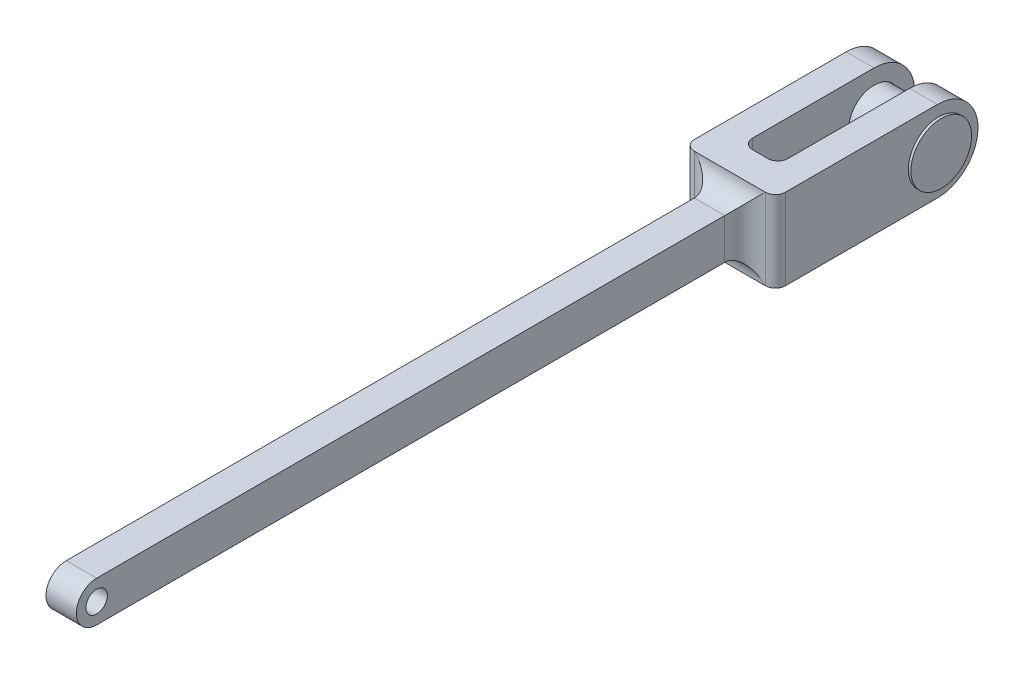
ISO-10303-21;
HEADER;
FILE_DESCRIPTION(('STEP AP214'),'2;1');
FILE_NAME('part.step','',(''),(''),'','','');
FILE_SCHEMA(('AUTOMOTIVE_DESIGN { 1 0 10303 214 1 1 1 1 }'));
ENDSEC;
DATA;
#1=APPLICATION_CONTEXT('core data for automotive mechanical design processes');
#2=APPLICATION_PROTOCOL_DEFINITION('international standard','automotive_design',2000,#1);
#3=PRODUCT_CONTEXT('',#1,'mechanical');
#4=PRODUCT('Part','Part','',(#3));
#5=PRODUCT_RELATED_PRODUCT_CATEGORY('part','',(#4));
#6=PRODUCT_DEFINITION_FORMATION('','',#4);
#7=PRODUCT_DEFINITION_CONTEXT('part definition',#1,'design');
#8=PRODUCT_DEFINITION('design','',#6,#7);
#9=PRODUCT_DEFINITION_SHAPE('','',#8);
#10=(LENGTH_UNIT() NAMED_UNIT(*) SI_UNIT(.MILLI.,.METRE.));
#11=(NAMED_UNIT(*) PLANE_ANGLE_UNIT() SI_UNIT($,.RADIAN.));
#12=(NAMED_UNIT(*) SI_UNIT($,.STERADIAN.) SOLID_ANGLE_UNIT());
#13=UNCERTAINTY_MEASURE_WITH_UNIT(LENGTH_MEASURE(1.E-05),#10,'distance_accuracy_value','');
#14=(GEOMETRIC_REPRESENTATION_CONTEXT(3) GLOBAL_UNCERTAINTY_ASSIGNED_CONTEXT((#13)) GLOBAL_UNIT_ASSIGNED_CONTEXT((#10,
#11,#12)) REPRESENTATION_CONTEXT('',''));
#15=CARTESIAN_POINT('',(0.,0.,0.));
#16=DIRECTION('',(0.,0.,1.));
#17=DIRECTION('',(1.,0.,0.));
#18=AXIS2_PLACEMENT_3D('',#15,#16,#17);
#19=CARTESIAN_POINT('',(29.36875,0.,-508.));
#20=DIRECTION('',(-1.,0.,0.));
#21=DIRECTION('',(0.,0.,1.));
#22=AXIS2_PLACEMENT_3D('',#19,#20,#21);
#23=CYLINDRICAL_SURFACE('',#22,15.875);
#24=CARTESIAN_POINT('',(29.36875,0.,-508.));
#25=DIRECTION('',(1.,0.,0.));
#26=DIRECTION('',(0.,0.,-1.));
#27=AXIS2_PLACEMENT_3D('',#24,#25,#26);
#28=CIRCLE('',#27,15.875);
#29=CARTESIAN_POINT('',(29.36875,0.,-523.875));
#30=VERTEX_POINT('',#29);
#31=EDGE_CURVE('E11',#30,#30,#28,.T.);
#32=ORIENTED_EDGE('',*,*,#31,.F.);
#33=EDGE_LOOP('',(#32));
#34=FACE_BOUND('',#33,.T.);
#35=CARTESIAN_POINT('',(-29.36875,0.,-508.));
#36=DIRECTION('',(1.,0.,0.));
#37=DIRECTION('',(0.,0.,-1.));
#38=AXIS2_PLACEMENT_3D('',#35,#36,#37);
#39=CIRCLE('',#38,15.875);
#40=CARTESIAN_POINT('',(-29.36875,0.,-523.875));
#41=VERTEX_POINT('',#40);
#42=EDGE_CURVE('E48',#41,#41,#39,.T.);
#43=ORIENTED_EDGE('',*,*,#42,.T.);
#44=EDGE_LOOP('',(#43));
#45=FACE_BOUND('',#44,.T.);
#46=ADVANCED_FACE('F45',(#34,#45),#23,.T.);
#47=CARTESIAN_POINT('',(30.95625,0.,-508.));
#48=DIRECTION('',(-1.,0.,0.));
#49=DIRECTION('',(0.,0.,1.));
#50=AXIS2_PLACEMENT_3D('',#47,#48,#49);
#51=CYLINDRICAL_SURFACE('',#50,19.05);
#52=CARTESIAN_POINT('',(30.95625,0.,-508.));
#53=DIRECTION('',(1.,0.,0.));
#54=DIRECTION('',(0.,0.,-1.));
#55=AXIS2_PLACEMENT_3D('',#52,#53,#54);
#56=CIRCLE('',#55,19.05);
#57=CARTESIAN_POINT('',(30.95625,0.,-527.05));
#58=VERTEX_POINT('',#57);
#59=EDGE_CURVE('E52',#58,#58,#56,.T.);
#60=ORIENTED_EDGE('',*,*,#59,.F.);
#61=EDGE_LOOP('',(#60));
#62=FACE_BOUND('',#61,.T.);
#63=CARTESIAN_POINT('',(29.36875,0.,-508.));
#64=DIRECTION('',(1.,0.,0.));
#65=DIRECTION('',(0.,0.,-1.));
#66=AXIS2_PLACEMENT_3D('',#63,#64,#65);
#67=CIRCLE('',#66,19.05);
#68=CARTESIAN_POINT('',(29.36875,0.,-527.05));
#69=VERTEX_POINT('',#68);
#70=EDGE_CURVE('E56',#69,#69,#67,.T.);
#71=ORIENTED_EDGE('',*,*,#70,.T.);
#72=EDGE_LOOP('',(#71));
#73=FACE_BOUND('',#72,.T.);
#74=ADVANCED_FACE('F93',(#62,#73),#51,.T.);
#75=CARTESIAN_POINT('',(30.95625,0.,-508.));
#76=DIRECTION('',(1.,0.,0.));
#77=DIRECTION('',(0.,0.,-1.));
#78=AXIS2_PLACEMENT_3D('',#75,#76,#77);
#79=PLANE('',#78);
#80=ORIENTED_EDGE('',*,*,#59,.T.);
#81=EDGE_LOOP('',(#80));
#82=FACE_BOUND('',#81,.T.);
#83=ADVANCED_FACE('F89',(#82),#79,.T.);
#84=CARTESIAN_POINT('',(29.36875,0.,-508.));
#85=DIRECTION('',(1.,0.,0.));
#86=DIRECTION('',(0.,0.,-1.));
#87=AXIS2_PLACEMENT_3D('',#84,#85,#86);
#88=PLANE('',#87);
#89=ORIENTED_EDGE('',*,*,#31,.T.);
#90=EDGE_LOOP('',(#89));
#91=FACE_BOUND('',#90,.T.);
#92=ORIENTED_EDGE('',*,*,#70,.F.);
#93=EDGE_LOOP('',(#92));
#94=FACE_BOUND('',#93,.T.);
#95=ADVANCED_FACE('F81',(#91,#94),#88,.F.);
#96=CARTESIAN_POINT('',(-30.95625,0.,-508.));
#97=DIRECTION('',(1.,0.,0.));
#98=DIRECTION('',(0.,0.,-1.));
#99=AXIS2_PLACEMENT_3D('',#96,#97,#98);
#100=CYLINDRICAL_SURFACE('',#99,19.05);
#101=CARTESIAN_POINT('',(-30.95625,0.,-508.));
#102=DIRECTION('',(1.,0.,0.));
#103=DIRECTION('',(0.,0.,-1.));
#104=AXIS2_PLACEMENT_3D('',#101,#102,#103);
#105=CIRCLE('',#104,19.05);
#106=CARTESIAN_POINT('',(-30.95625,0.,-527.05));
#107=VERTEX_POINT('',#106);
#108=EDGE_CURVE('E64',#107,#107,#105,.T.);
#109=ORIENTED_EDGE('',*,*,#108,.T.);
#110=EDGE_LOOP('',(#109));
#111=FACE_BOUND('',#110,.T.);
#112=CARTESIAN_POINT('',(-29.36875,0.,-508.));
#113=DIRECTION('',(1.,0.,0.));
#114=DIRECTION('',(0.,0.,-1.));
#115=AXIS2_PLACEMENT_3D('',#112,#113,#114);
#116=CIRCLE('',#115,19.05);
#117=CARTESIAN_POINT('',(-29.36875,0.,-527.05));
#118=VERTEX_POINT('',#117);
#119=EDGE_CURVE('E61',#118,#118,#116,.T.);
#120=ORIENTED_EDGE('',*,*,#119,.F.);
#121=EDGE_LOOP('',(#120));
#122=FACE_BOUND('',#121,.T.);
#123=ADVANCED_FACE('F79',(#111,#122),#100,.T.);
#124=CARTESIAN_POINT('',(-30.95625,0.,-508.));
#125=DIRECTION('',(-1.,0.,0.));
#126=DIRECTION('',(0.,0.,-1.));
#127=AXIS2_PLACEMENT_3D('',#124,#125,#126);
#128=PLANE('',#127);
#129=ORIENTED_EDGE('',*,*,#108,.F.);
#130=EDGE_LOOP('',(#129));
#131=FACE_BOUND('',#130,.T.);
#132=ADVANCED_FACE('F75',(#131),#128,.T.);
#133=CARTESIAN_POINT('',(-29.36875,0.,-508.));
#134=DIRECTION('',(-1.,0.,0.));
#135=DIRECTION('',(0.,0.,-1.));
#136=AXIS2_PLACEMENT_3D('',#133,#134,#135);
#137=PLANE('',#136);
#138=ORIENTED_EDGE('',*,*,#42,.F.);
#139=EDGE_LOOP('',(#138));
#140=FACE_BOUND('',#139,.T.);
#141=ORIENTED_EDGE('',*,*,#119,.T.);
#142=EDGE_LOOP('',(#141));
#143=FACE_BOUND('',#142,.T.);
#144=ADVANCED_FACE('F72',(#140,#143),#137,.F.);
#145=CLOSED_SHELL('',(#46,#74,#83,#95,#123,#132,#144));
#146=MANIFOLD_SOLID_BREP('B2',#145);
#147=CARTESIAN_POINT('',(-165.358186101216,0.,-508.));
#148=DIRECTION('',(1.,0.,0.));
#149=DIRECTION('',(0.,0.,-1.));
#150=AXIS2_PLACEMENT_3D('',#147,#148,#149);
#151=CYLINDRICAL_SURFACE('',#150,25.4);
#152=CARTESIAN_POINT('',(11.1125,0.,-508.));
#153=DIRECTION('',(1.,0.,0.));
#154=DIRECTION('',(0.,0.,-1.));
#155=AXIS2_PLACEMENT_3D('',#152,#153,#154);
#156=CIRCLE('',#155,25.4);
#157=CARTESIAN_POINT('',(11.1125,25.4,-508.));
#158=VERTEX_POINT('',#157);
#159=CARTESIAN_POINT('',(11.1125,-25.4,-508.));
#160=VERTEX_POINT('',#159);
#161=EDGE_CURVE('E352',#158,#160,#156,.F.);
#162=ORIENTED_EDGE('',*,*,#161,.F.);
#163=DIRECTION('',(1.,0.,0.));
#164=VECTOR('',#163,1.);
#165=CARTESIAN_POINT('',(-165.358186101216,25.4,-508.));
#166=LINE('',#165,#164);
#167=CARTESIAN_POINT('',(28.575,25.4,-508.));
#168=VERTEX_POINT('',#167);
#169=EDGE_CURVE('E309',#158,#168,#166,.T.);
#170=ORIENTED_EDGE('',*,*,#169,.T.);
#171=CARTESIAN_POINT('',(28.575,0.,-508.));
#172=DIRECTION('',(1.,0.,0.));
#173=DIRECTION('',(0.,0.,1.));
#174=AXIS2_PLACEMENT_3D('',#171,#172,#173);
#175=CIRCLE('',#174,25.4);
#176=CARTESIAN_POINT('',(28.575,-25.4,-508.));
#177=VERTEX_POINT('',#176);
#178=EDGE_CURVE('E435',#177,#168,#175,.T.);
#179=ORIENTED_EDGE('',*,*,#178,.F.);
#180=DIRECTION('',(1.,0.,0.));
#181=VECTOR('',#180,1.);
#182=CARTESIAN_POINT('',(-165.358186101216,-25.4,-508.));
#183=LINE('',#182,#181);
#184=EDGE_CURVE('E310',#160,#177,#183,.T.);
#185=ORIENTED_EDGE('',*,*,#184,.F.);
#186=EDGE_LOOP('',(#162,#170,#179,#185));
#187=FACE_BOUND('',#186,.T.);
#188=ADVANCED_FACE('F165',(#187),#151,.T.);
#189=CARTESIAN_POINT('',(-74.0150959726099,0.,-508.));
#190=DIRECTION('',(1.,0.,0.));
#191=DIRECTION('',(0.,0.,-1.));
#192=AXIS2_PLACEMENT_3D('',#189,#190,#191);
#193=CYLINDRICAL_SURFACE('',#192,16.0655);
#194=CARTESIAN_POINT('',(11.1125,0.,-508.));
#195=DIRECTION('',(1.,0.,0.));
#196=DIRECTION('',(0.,0.,-1.));
#197=AXIS2_PLACEMENT_3D('',#194,#195,#196);
#198=CIRCLE('',#197,16.0655);
#199=CARTESIAN_POINT('',(11.1125,0.,-524.0655));
#200=VERTEX_POINT('',#199);
#201=EDGE_CURVE('E302',#200,#200,#198,.F.);
#202=ORIENTED_EDGE('',*,*,#201,.T.);
#203=EDGE_LOOP('',(#202));
#204=FACE_BOUND('',#203,.T.);
#205=CARTESIAN_POINT('',(28.575,0.,-508.));
#206=DIRECTION('',(1.,0.,0.));
#207=DIRECTION('',(0.,0.,-1.));
#208=AXIS2_PLACEMENT_3D('',#205,#206,#207);
#209=CIRCLE('',#208,16.0655);
#210=CARTESIAN_POINT('',(28.575,0.,-524.0655));
#211=VERTEX_POINT('',#210);
#212=EDGE_CURVE('E421',#211,#211,#209,.T.);
#213=ORIENTED_EDGE('',*,*,#212,.T.);
#214=EDGE_LOOP('',(#213));
#215=FACE_BOUND('',#214,.T.);
#216=ADVANCED_FACE('F498',(#204,#215),#193,.F.);
#217=CARTESIAN_POINT('',(9.525,0.,0.));
#218=DIRECTION('',(1.,0.,0.));
#219=DIRECTION('',(0.,0.,-1.));
#220=AXIS2_PLACEMENT_3D('',#217,#218,#219);
#221=PLANE('',#220);
#222=DIRECTION('',(0.,0.,-1.));
#223=VECTOR('',#222,1.);
#224=CARTESIAN_POINT('',(9.525,-12.7,0.));
#225=LINE('',#224,#223);
#226=CARTESIAN_POINT('',(9.525,-12.7,0.));
#227=VERTEX_POINT('',#226);
#228=CARTESIAN_POINT('',(9.525,-12.7,-393.7));
#229=VERTEX_POINT('',#228);
#230=EDGE_CURVE('E330',#227,#229,#225,.T.);
#231=ORIENTED_EDGE('',*,*,#230,.T.);
#232=DIRECTION('',(0.,-1.,0.));
#233=VECTOR('',#232,1.);
#234=CARTESIAN_POINT('',(9.525,12.7,-393.7));
#235=LINE('',#234,#233);
#236=CARTESIAN_POINT('',(9.525,12.7,-393.7));
#237=VERTEX_POINT('',#236);
#238=EDGE_CURVE('E43',#229,#237,#235,.F.);
#239=ORIENTED_EDGE('',*,*,#238,.T.);
#240=DIRECTION('',(0.,0.,1.));
#241=VECTOR('',#240,1.);
#242=CARTESIAN_POINT('',(9.525,12.7,0.));
#243=LINE('',#242,#241);
#244=CARTESIAN_POINT('',(9.525,12.7,0.));
#245=VERTEX_POINT('',#244);
#246=EDGE_CURVE('E333',#237,#245,#243,.T.);
#247=ORIENTED_EDGE('',*,*,#246,.T.);
#248=CARTESIAN_POINT('',(9.525,0.,0.));
#249=DIRECTION('',(1.,0.,0.));
#250=DIRECTION('',(0.,0.,-1.));
#251=AXIS2_PLACEMENT_3D('',#248,#249,#250);
#252=CIRCLE('',#251,12.7);
#253=EDGE_CURVE('E327',#245,#227,#252,.T.);
#254=ORIENTED_EDGE('',*,*,#253,.T.);
#255=EDGE_LOOP('',(#231,#239,#247,#254));
#256=FACE_BOUND('',#255,.T.);
#257=CARTESIAN_POINT('',(9.525,0.,0.));
#258=DIRECTION('',(1.,0.,0.));
#259=DIRECTION('',(0.,0.,-1.));
#260=AXIS2_PLACEMENT_3D('',#257,#258,#259);
#261=CIRCLE('',#260,6.731);
#262=CARTESIAN_POINT('',(9.525,0.,6.731));
#263=VERTEX_POINT('',#262);
#264=EDGE_CURVE('E320',#263,#263,#261,.T.);
#265=ORIENTED_EDGE('',*,*,#264,.F.);
#266=EDGE_LOOP('',(#265));
#267=FACE_BOUND('',#266,.T.);
#268=ADVANCED_FACE('F503',(#256,#267),#221,.T.);
#269=CARTESIAN_POINT('',(-9.525,0.,0.));
#270=DIRECTION('',(1.,0.,0.));
#271=DIRECTION('',(0.,0.,-1.));
#272=AXIS2_PLACEMENT_3D('',#269,#270,#271);
#273=PLANE('',#272);
#274=DIRECTION('',(0.,0.,1.));
#275=VECTOR('',#274,1.);
#276=CARTESIAN_POINT('',(-9.525,12.7,0.));
#277=LINE('',#276,#275);
#278=CARTESIAN_POINT('',(-9.525,12.7,-393.7));
#279=VERTEX_POINT('',#278);
#280=CARTESIAN_POINT('',(-9.525,12.7,0.));
#281=VERTEX_POINT('',#280);
#282=EDGE_CURVE('E331',#279,#281,#277,.T.);
#283=ORIENTED_EDGE('',*,*,#282,.F.);
#284=DIRECTION('',(0.,-1.,0.));
#285=VECTOR('',#284,1.);
#286=CARTESIAN_POINT('',(-9.525,0.,-393.7));
#287=LINE('',#286,#285);
#288=CARTESIAN_POINT('',(-9.525,-12.7,-393.7));
#289=VERTEX_POINT('',#288);
#290=EDGE_CURVE('E174',#279,#289,#287,.T.);
#291=ORIENTED_EDGE('',*,*,#290,.T.);
#292=DIRECTION('',(0.,0.,-1.));
#293=VECTOR('',#292,1.);
#294=CARTESIAN_POINT('',(-9.525,-12.7,0.));
#295=LINE('',#294,#293);
#296=CARTESIAN_POINT('',(-9.525,-12.7,0.));
#297=VERTEX_POINT('',#296);
#298=EDGE_CURVE('E338',#297,#289,#295,.T.);
#299=ORIENTED_EDGE('',*,*,#298,.F.);
#300=CARTESIAN_POINT('',(-9.525,0.,0.));
#301=DIRECTION('',(1.,0.,0.));
#302=DIRECTION('',(0.,0.,-1.));
#303=AXIS2_PLACEMENT_3D('',#300,#301,#302);
#304=CIRCLE('',#303,12.7);
#305=EDGE_CURVE('E323',#281,#297,#304,.T.);
#306=ORIENTED_EDGE('',*,*,#305,.F.);
#307=EDGE_LOOP('',(#283,#291,#299,#306));
#308=FACE_BOUND('',#307,.T.);
#309=CARTESIAN_POINT('',(-9.525,0.,0.));
#310=DIRECTION('',(1.,0.,0.));
#311=DIRECTION('',(0.,0.,-1.));
#312=AXIS2_PLACEMENT_3D('',#309,#310,#311);
#313=CIRCLE('',#312,6.731);
#314=CARTESIAN_POINT('',(-9.525,0.,6.731));
#315=VERTEX_POINT('',#314);
#316=EDGE_CURVE('E324',#315,#315,#313,.T.);
#317=ORIENTED_EDGE('',*,*,#316,.T.);
#318=EDGE_LOOP('',(#317));
#319=FACE_BOUND('',#318,.T.);
#320=ADVANCED_FACE('F608',(#308,#319),#273,.F.);
#321=CARTESIAN_POINT('',(9.525,0.,0.));
#322=DIRECTION('',(-1.,0.,0.));
#323=DIRECTION('',(0.,0.,1.));
#324=AXIS2_PLACEMENT_3D('',#321,#322,#323);
#325=CYLINDRICAL_SURFACE('',#324,12.7);
#326=ORIENTED_EDGE('',*,*,#305,.T.);
#327=DIRECTION('',(-1.,0.,0.));
#328=VECTOR('',#327,1.);
#329=CARTESIAN_POINT('',(9.525,-12.7,0.));
#330=LINE('',#329,#328);
#331=EDGE_CURVE('E344',#227,#297,#330,.T.);
#332=ORIENTED_EDGE('',*,*,#331,.F.);
#333=ORIENTED_EDGE('',*,*,#253,.F.);
#334=DIRECTION('',(-1.,0.,0.));
#335=VECTOR('',#334,1.);
#336=CARTESIAN_POINT('',(9.525,12.7,0.));
#337=LINE('',#336,#335);
#338=EDGE_CURVE('E335',#245,#281,#337,.T.);
#339=ORIENTED_EDGE('',*,*,#338,.T.);
#340=EDGE_LOOP('',(#326,#332,#333,#339));
#341=FACE_BOUND('',#340,.T.);
#342=ADVANCED_FACE('F531',(#341),#325,.T.);
#343=CARTESIAN_POINT('',(9.525,-12.7,0.));
#344=DIRECTION('',(0.,1.,0.));
#345=DIRECTION('',(0.,0.,1.));
#346=AXIS2_PLACEMENT_3D('',#343,#344,#345);
#347=PLANE('',#346);
#348=ORIENTED_EDGE('',*,*,#298,.T.);
#349=DIRECTION('',(1.,0.,0.));
#350=VECTOR('',#349,1.);
#351=CARTESIAN_POINT('',(9.525,-12.7,-393.7));
#352=LINE('',#351,#350);
#353=EDGE_CURVE('E389',#289,#229,#352,.T.);
#354=ORIENTED_EDGE('',*,*,#353,.T.);
#355=ORIENTED_EDGE('',*,*,#230,.F.);
#356=ORIENTED_EDGE('',*,*,#331,.T.);
#357=EDGE_LOOP('',(#348,#354,#355,#356));
#358=FACE_BOUND('',#357,.T.);
#359=ADVANCED_FACE('F589',(#358),#347,.F.);
#360=CARTESIAN_POINT('',(9.525,12.7,0.));
#361=DIRECTION('',(0.,-1.,0.));
#362=DIRECTION('',(0.,0.,-1.));
#363=AXIS2_PLACEMENT_3D('',#360,#361,#362);
#364=PLANE('',#363);
#365=ORIENTED_EDGE('',*,*,#246,.F.);
#366=DIRECTION('',(-1.,0.,0.));
#367=VECTOR('',#366,1.);
#368=CARTESIAN_POINT('',(9.525,12.7,-393.7));
#369=LINE('',#368,#367);
#370=EDGE_CURVE('E182',#237,#279,#369,.T.);
#371=ORIENTED_EDGE('',*,*,#370,.T.);
#372=ORIENTED_EDGE('',*,*,#282,.T.);
#373=ORIENTED_EDGE('',*,*,#338,.F.);
#374=EDGE_LOOP('',(#365,#371,#372,#373));
#375=FACE_BOUND('',#374,.T.);
#376=ADVANCED_FACE('F584',(#375),#364,.F.);
#377=CARTESIAN_POINT('',(9.525,0.,0.));
#378=DIRECTION('',(-1.,0.,0.));
#379=DIRECTION('',(0.,0.,1.));
#380=AXIS2_PLACEMENT_3D('',#377,#378,#379);
#381=CYLINDRICAL_SURFACE('',#380,6.731);
#382=CARTESIAN_POINT('',(9.525,0.,6.731));
#383=CARTESIAN_POINT('',(9.3265625,0.,6.731));
#384=CARTESIAN_POINT('',(9.128125,0.,6.731));
#385=CARTESIAN_POINT('',(8.73125,0.,6.731));
#386=CARTESIAN_POINT('',(8.5328125,0.,6.731));
#387=CARTESIAN_POINT('',(8.1359375,0.,6.731));
#388=CARTESIAN_POINT('',(7.9375,0.,6.731));
#389=CARTESIAN_POINT('',(7.540625,0.,6.731));
#390=CARTESIAN_POINT('',(7.3421875,0.,6.731));
#391=CARTESIAN_POINT('',(6.9453125,0.,6.731));
#392=CARTESIAN_POINT('',(6.746875,0.,6.731));
#393=CARTESIAN_POINT('',(6.35,0.,6.731));
#394=CARTESIAN_POINT('',(6.1515625,0.,6.731));
#395=CARTESIAN_POINT('',(5.7546875,0.,6.731));
#396=CARTESIAN_POINT('',(5.55625,0.,6.731));
#397=CARTESIAN_POINT('',(5.159375,0.,6.731));
#398=CARTESIAN_POINT('',(4.9609375,0.,6.731));
#399=CARTESIAN_POINT('',(4.5640625,0.,6.731));
#400=CARTESIAN_POINT('',(4.365625,0.,6.731));
#401=CARTESIAN_POINT('',(3.96875,0.,6.731));
#402=CARTESIAN_POINT('',(3.7703125,0.,6.731));
#403=CARTESIAN_POINT('',(3.3734375,0.,6.731));
#404=CARTESIAN_POINT('',(3.175,0.,6.731));
#405=CARTESIAN_POINT('',(2.778125,0.,6.731));
#406=CARTESIAN_POINT('',(2.5796875,0.,6.731));
#407=CARTESIAN_POINT('',(2.1828125,0.,6.731));
#408=CARTESIAN_POINT('',(1.984375,0.,6.731));
#409=CARTESIAN_POINT('',(1.5875,0.,6.731));
#410=CARTESIAN_POINT('',(1.3890625,0.,6.731));
#411=CARTESIAN_POINT('',(0.992187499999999,0.,6.731));
#412=CARTESIAN_POINT('',(0.793749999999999,0.,6.731));
#413=CARTESIAN_POINT('',(0.396874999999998,0.,6.731));
#414=CARTESIAN_POINT('',(0.198437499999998,0.,6.731));
#415=CARTESIAN_POINT('',(-0.198437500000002,0.,6.731));
#416=CARTESIAN_POINT('',(-0.396875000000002,0.,6.731));
#417=CARTESIAN_POINT('',(-0.793750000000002,0.,6.731));
#418=CARTESIAN_POINT('',(-0.992187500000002,0.,6.731));
#419=CARTESIAN_POINT('',(-1.3890625,0.,6.731));
#420=CARTESIAN_POINT('',(-1.5875,0.,6.731));
#421=CARTESIAN_POINT('',(-1.984375,0.,6.731));
#422=CARTESIAN_POINT('',(-2.1828125,0.,6.731));
#423=CARTESIAN_POINT('',(-2.5796875,0.,6.731));
#424=CARTESIAN_POINT('',(-2.778125,0.,6.731));
#425=CARTESIAN_POINT('',(-3.175,0.,6.731));
#426=CARTESIAN_POINT('',(-3.3734375,0.,6.731));
#427=CARTESIAN_POINT('',(-3.7703125,0.,6.731));
#428=CARTESIAN_POINT('',(-3.96875,0.,6.731));
#429=CARTESIAN_POINT('',(-4.365625,0.,6.731));
#430=CARTESIAN_POINT('',(-4.5640625,0.,6.731));
#431=CARTESIAN_POINT('',(-4.9609375,0.,6.731));
#432=CARTESIAN_POINT('',(-5.159375,0.,6.731));
#433=CARTESIAN_POINT('',(-5.55625,0.,6.731));
#434=CARTESIAN_POINT('',(-5.7546875,0.,6.731));
#435=CARTESIAN_POINT('',(-6.1515625,0.,6.731));
#436=CARTESIAN_POINT('',(-6.35,0.,6.731));
#437=CARTESIAN_POINT('',(-6.746875,0.,6.731));
#438=CARTESIAN_POINT('',(-6.9453125,0.,6.731));
#439=CARTESIAN_POINT('',(-7.3421875,0.,6.731));
#440=CARTESIAN_POINT('',(-7.540625,0.,6.731));
#441=CARTESIAN_POINT('',(-7.9375,0.,6.731));
#442=CARTESIAN_POINT('',(-8.1359375,0.,6.731));
#443=CARTESIAN_POINT('',(-8.5328125,0.,6.731));
#444=CARTESIAN_POINT('',(-8.73125,0.,6.731));
#445=CARTESIAN_POINT('',(-9.128125,0.,6.731));
#446=CARTESIAN_POINT('',(-9.3265625,0.,6.731));
#447=CARTESIAN_POINT('',(-9.525,0.,6.731));
#448=B_SPLINE_CURVE_WITH_KNOTS('',3,(#382,#383,#384,#385,#386,#387,#388,#389,#390,#391,#392,
#393,#394,#395,#396,#397,#398,#399,#400,#401,#402,#403,#404,#405,#406,#407,#408,#409,#410,#411,
#412,#413,#414,#415,#416,#417,#418,#419,#420,#421,#422,#423,#424,#425,#426,#427,#428,#429,#430,
#431,#432,#433,#434,#435,#436,#437,#438,#439,#440,#441,#442,#443,#444,#445,#446,#447),
.UNSPECIFIED.,.F.,.F.,(4,2,2,2,2,2,2,2,2,2,2,2,2,2,2,2,2,2,2,2,2,2,2,2,2,2,2,2,2,2,2,2,4),(0.,
0.595312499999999,1.190625,1.7859375,2.38125,2.9765625,3.571875,4.1671875,4.7625,5.3578125,
5.953125,6.5484375,7.14375,7.7390625,8.334375,8.9296875,9.525,10.1203125,10.715625,11.3109375,
11.90625,12.5015625,13.096875,13.6921875,14.2875,14.8828125,15.478125,16.0734375,16.66875,
17.2640625,17.859375,18.4546875,19.05),.UNSPECIFIED.);
#449=EDGE_CURVE('BSEAM493',#263,#315,#448,.T.);
#450=ORIENTED_EDGE('',*,*,#264,.T.);
#451=ORIENTED_EDGE('',*,*,#316,.F.);
#452=ORIENTED_EDGE('',*,*,#449,.T.);
#453=ORIENTED_EDGE('',*,*,#449,.F.);
#454=EDGE_LOOP('',(#450,#452,#451,#453));
#455=FACE_BOUND('',#454,.T.);
#456=ADVANCED_FACE('F493',(#455),#381,.F.);
#457=CARTESIAN_POINT('',(-28.575,0.,0.));
#458=DIRECTION('',(1.,0.,0.));
#459=DIRECTION('',(0.,0.,-1.));
#460=AXIS2_PLACEMENT_3D('',#457,#458,#459);
#461=PLANE('',#460);
#462=CARTESIAN_POINT('',(-28.575,0.,-508.));
#463=DIRECTION('',(1.,0.,0.));
#464=DIRECTION('',(0.,0.,-1.));
#465=AXIS2_PLACEMENT_3D('',#462,#463,#464);
#466=CIRCLE('',#465,16.0655);
#467=CARTESIAN_POINT('',(-28.575,0.,-524.0655));
#468=VERTEX_POINT('',#467);
#469=EDGE_CURVE('E424',#468,#468,#466,.F.);
#470=ORIENTED_EDGE('',*,*,#469,.F.);
#471=EDGE_LOOP('',(#470));
#472=FACE_BOUND('',#471,.T.);
#473=DIRECTION('',(0.,0.,1.));
#474=VECTOR('',#473,1.);
#475=CARTESIAN_POINT('',(-28.575,-25.4,-508.));
#476=LINE('',#475,#474);
#477=CARTESIAN_POINT('',(-28.5750000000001,-25.4,-508.));
#478=VERTEX_POINT('',#477);
#479=CARTESIAN_POINT('',(-28.575,-25.4,-412.75));
#480=VERTEX_POINT('',#479);
#481=EDGE_CURVE('E308',#478,#480,#476,.T.);
#482=ORIENTED_EDGE('',*,*,#481,.T.);
#483=DIRECTION('',(0.,1.,0.));
#484=VECTOR('',#483,1.);
#485=CARTESIAN_POINT('',(-28.575,25.4,-412.75));
#486=LINE('',#485,#484);
#487=CARTESIAN_POINT('',(-28.575,25.4,-412.75));
#488=VERTEX_POINT('',#487);
#489=EDGE_CURVE('E369',#480,#488,#486,.T.);
#490=ORIENTED_EDGE('',*,*,#489,.T.);
#491=DIRECTION('',(0.,0.,-1.));
#492=VECTOR('',#491,1.);
#493=CARTESIAN_POINT('',(-28.575,25.4,-406.4));
#494=LINE('',#493,#492);
#495=CARTESIAN_POINT('',(-28.575,25.4,-508.));
#496=VERTEX_POINT('',#495);
#497=EDGE_CURVE('E429',#488,#496,#494,.T.);
#498=ORIENTED_EDGE('',*,*,#497,.T.);
#499=CARTESIAN_POINT('',(-28.575,0.,-508.));
#500=DIRECTION('',(1.,0.,0.));
#501=DIRECTION('',(0.,0.,-1.));
#502=AXIS2_PLACEMENT_3D('',#499,#500,#501);
#503=CIRCLE('',#502,25.4);
#504=EDGE_CURVE('E430',#496,#478,#503,.F.);
#505=ORIENTED_EDGE('',*,*,#504,.T.);
#506=EDGE_LOOP('',(#482,#490,#498,#505));
#507=FACE_BOUND('',#506,.T.);
#508=ADVANCED_FACE('F463',(#472,#507),#461,.F.);
#509=CARTESIAN_POINT('',(28.575,0.,-508.));
#510=DIRECTION('',(1.,0.,0.));
#511=DIRECTION('',(0.,0.,-1.));
#512=AXIS2_PLACEMENT_3D('',#509,#510,#511);
#513=PLANE('',#512);
#514=ORIENTED_EDGE('',*,*,#212,.F.);
#515=EDGE_LOOP('',(#514));
#516=FACE_BOUND('',#515,.T.);
#517=DIRECTION('',(0.,0.,1.));
#518=VECTOR('',#517,1.);
#519=CARTESIAN_POINT('',(28.575,25.4,-406.4));
#520=LINE('',#519,#518);
#521=CARTESIAN_POINT('',(28.575,25.4,-412.75));
#522=VERTEX_POINT('',#521);
#523=EDGE_CURVE('E319',#168,#522,#520,.T.);
#524=ORIENTED_EDGE('',*,*,#523,.T.);
#525=DIRECTION('',(0.,-1.,0.));
#526=VECTOR('',#525,1.);
#527=CARTESIAN_POINT('',(28.575,0.,-412.75));
#528=LINE('',#527,#526);
#529=CARTESIAN_POINT('',(28.575,-25.4,-412.75));
#530=VERTEX_POINT('',#529);
#531=EDGE_CURVE('E347',#522,#530,#528,.T.);
#532=ORIENTED_EDGE('',*,*,#531,.T.);
#533=DIRECTION('',(0.,0.,-1.));
#534=VECTOR('',#533,1.);
#535=CARTESIAN_POINT('',(28.575,-25.4,-508.));
#536=LINE('',#535,#534);
#537=EDGE_CURVE('E427',#530,#177,#536,.T.);
#538=ORIENTED_EDGE('',*,*,#537,.T.);
#539=ORIENTED_EDGE('',*,*,#178,.T.);
#540=EDGE_LOOP('',(#524,#532,#538,#539));
#541=FACE_BOUND('',#540,.T.);
#542=ADVANCED_FACE('F484',(#516,#541),#513,.T.);
#543=CARTESIAN_POINT('',(-165.358186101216,-25.4,-508.));
#544=DIRECTION('',(0.,-1.,0.));
#545=DIRECTION('',(0.,0.,-1.));
#546=AXIS2_PLACEMENT_3D('',#543,#544,#545);
#547=PLANE('',#546);
#548=ORIENTED_EDGE('',*,*,#537,.F.);
#549=CARTESIAN_POINT('',(22.225,-25.4,-412.75));
#550=DIRECTION('',(0.,-1.,0.));
#551=DIRECTION('',(0.,0.,-1.));
#552=AXIS2_PLACEMENT_3D('',#549,#550,#551);
#553=CIRCLE('',#552,6.35);
#554=CARTESIAN_POINT('',(22.2249999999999,-25.4,-406.4));
#555=VERTEX_POINT('',#554);
#556=EDGE_CURVE('E357',#530,#555,#553,.T.);
#557=ORIENTED_EDGE('',*,*,#556,.T.);
#558=DIRECTION('',(1.,0.,0.));
#559=VECTOR('',#558,1.);
#560=CARTESIAN_POINT('',(-165.358186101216,-25.4,-406.4));
#561=LINE('',#560,#559);
#562=CARTESIAN_POINT('',(-22.2250000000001,-25.4,-406.4));
#563=VERTEX_POINT('',#562);
#564=EDGE_CURVE('E314',#563,#555,#561,.T.);
#565=ORIENTED_EDGE('',*,*,#564,.F.);
#566=CARTESIAN_POINT('',(-22.225,-25.4,-412.75));
#567=DIRECTION('',(0.,-1.,0.));
#568=DIRECTION('',(0.,0.,-1.));
#569=AXIS2_PLACEMENT_3D('',#566,#567,#568);
#570=CIRCLE('',#569,6.35);
#571=EDGE_CURVE('E355',#563,#480,#570,.T.);
#572=ORIENTED_EDGE('',*,*,#571,.T.);
#573=ORIENTED_EDGE('',*,*,#481,.F.);
#574=CARTESIAN_POINT('',(-11.1125,-25.4,-508.));
#575=VERTEX_POINT('',#574);
#576=EDGE_CURVE('E298',#478,#575,#183,.T.);
#577=ORIENTED_EDGE('',*,*,#576,.T.);
#578=DIRECTION('',(0.,0.,1.));
#579=VECTOR('',#578,1.);
#580=CARTESIAN_POINT('',(-11.1125,-25.4,-590.55));
#581=LINE('',#580,#579);
#582=CARTESIAN_POINT('',(-11.1125,-25.4,-431.8));
#583=VERTEX_POINT('',#582);
#584=EDGE_CURVE('E278',#575,#583,#581,.T.);
#585=ORIENTED_EDGE('',*,*,#584,.T.);
#586=CARTESIAN_POINT('',(-4.76249999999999,-25.4,-431.8));
#587=DIRECTION('',(0.,-1.,0.));
#588=DIRECTION('',(0.,0.,-1.));
#589=AXIS2_PLACEMENT_3D('',#586,#587,#588);
#590=CIRCLE('',#589,6.35);
#591=CARTESIAN_POINT('',(-4.76249999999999,-25.4,-425.45));
#592=VERTEX_POINT('',#591);
#593=EDGE_CURVE('E387',#583,#592,#590,.F.);
#594=ORIENTED_EDGE('',*,*,#593,.T.);
#595=DIRECTION('',(1.,0.,0.));
#596=VECTOR('',#595,1.);
#597=CARTESIAN_POINT('',(-11.1125,-25.4,-425.45));
#598=LINE('',#597,#596);
#599=CARTESIAN_POINT('',(4.76250000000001,-25.4,-425.45));
#600=VERTEX_POINT('',#599);
#601=EDGE_CURVE('E290',#592,#600,#598,.T.);
#602=ORIENTED_EDGE('',*,*,#601,.T.);
#603=CARTESIAN_POINT('',(4.76250000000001,-25.4,-431.8));
#604=DIRECTION('',(0.,-1.,0.));
#605=DIRECTION('',(0.,0.,-1.));
#606=AXIS2_PLACEMENT_3D('',#603,#604,#605);
#607=CIRCLE('',#606,6.35);
#608=CARTESIAN_POINT('',(11.1125,-25.4,-431.8));
#609=VERTEX_POINT('',#608);
#610=EDGE_CURVE('E383',#600,#609,#607,.F.);
#611=ORIENTED_EDGE('',*,*,#610,.T.);
#612=DIRECTION('',(0.,0.,-1.));
#613=VECTOR('',#612,1.);
#614=CARTESIAN_POINT('',(11.1125,-25.4,-590.55));
#615=LINE('',#614,#613);
#616=EDGE_CURVE('E291',#609,#160,#615,.T.);
#617=ORIENTED_EDGE('',*,*,#616,.T.);
#618=ORIENTED_EDGE('',*,*,#184,.T.);
#619=EDGE_LOOP('',(#548,#557,#565,#572,#573,#577,#585,#594,#602,#611,#617,#618));
#620=FACE_BOUND('',#619,.T.);
#621=ADVANCED_FACE('F306',(#620),#547,.T.);
#622=CARTESIAN_POINT('',(-11.1125,0.,-508.));
#623=DIRECTION('',(-1.,0.,0.));
#624=DIRECTION('',(0.,0.,1.));
#625=AXIS2_PLACEMENT_3D('',#622,#623,#624);
#626=CIRCLE('',#625,25.4);
#627=CARTESIAN_POINT('',(-11.1125,25.4,-508.));
#628=VERTEX_POINT('',#627);
#629=EDGE_CURVE('E283',#575,#628,#626,.F.);
#630=ORIENTED_EDGE('',*,*,#629,.F.);
#631=ORIENTED_EDGE('',*,*,#576,.F.);
#632=ORIENTED_EDGE('',*,*,#504,.F.);
#633=EDGE_CURVE('E301',#496,#628,#166,.T.);
#634=ORIENTED_EDGE('',*,*,#633,.T.);
#635=EDGE_LOOP('',(#630,#631,#632,#634));
#636=FACE_BOUND('',#635,.T.);
#637=ADVANCED_FACE('F296',(#636),#151,.T.);
#638=CARTESIAN_POINT('',(-165.358186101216,25.4,-406.4));
#639=DIRECTION('',(0.,1.,0.));
#640=DIRECTION('',(0.,0.,1.));
#641=AXIS2_PLACEMENT_3D('',#638,#639,#640);
#642=PLANE('',#641);
#643=DIRECTION('',(1.,0.,0.));
#644=VECTOR('',#643,1.);
#645=CARTESIAN_POINT('',(-165.358186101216,25.4,-406.4));
#646=LINE('',#645,#644);
#647=CARTESIAN_POINT('',(-22.2250000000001,25.4,-406.4));
#648=VERTEX_POINT('',#647);
#649=CARTESIAN_POINT('',(22.2249999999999,25.4,-406.4));
#650=VERTEX_POINT('',#649);
#651=EDGE_CURVE('E432',#648,#650,#646,.T.);
#652=ORIENTED_EDGE('',*,*,#651,.T.);
#653=CARTESIAN_POINT('',(22.225,25.4,-412.75));
#654=DIRECTION('',(0.,1.,0.));
#655=DIRECTION('',(0.,0.,1.));
#656=AXIS2_PLACEMENT_3D('',#653,#654,#655);
#657=CIRCLE('',#656,6.35);
#658=EDGE_CURVE('E367',#650,#522,#657,.T.);
#659=ORIENTED_EDGE('',*,*,#658,.T.);
#660=ORIENTED_EDGE('',*,*,#523,.F.);
#661=ORIENTED_EDGE('',*,*,#169,.F.);
#662=DIRECTION('',(0.,0.,-1.));
#663=VECTOR('',#662,1.);
#664=CARTESIAN_POINT('',(11.1125,25.4,-590.55));
#665=LINE('',#664,#663);
#666=CARTESIAN_POINT('',(11.1125,25.4,-431.8));
#667=VERTEX_POINT('',#666);
#668=EDGE_CURVE('E402',#667,#158,#665,.T.);
#669=ORIENTED_EDGE('',*,*,#668,.F.);
#670=CARTESIAN_POINT('',(4.76250000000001,25.4,-431.8));
#671=DIRECTION('',(0.,1.,0.));
#672=DIRECTION('',(0.,0.,1.));
#673=AXIS2_PLACEMENT_3D('',#670,#671,#672);
#674=CIRCLE('',#673,6.35);
#675=CARTESIAN_POINT('',(4.76250000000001,25.4,-425.45));
#676=VERTEX_POINT('',#675);
#677=EDGE_CURVE('E381',#667,#676,#674,.F.);
#678=ORIENTED_EDGE('',*,*,#677,.T.);
#679=DIRECTION('',(1.,0.,0.));
#680=VECTOR('',#679,1.);
#681=CARTESIAN_POINT('',(-11.1125,25.4,-425.45));
#682=LINE('',#681,#680);
#683=CARTESIAN_POINT('',(-4.76249999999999,25.4,-425.45));
#684=VERTEX_POINT('',#683);
#685=EDGE_CURVE('E412',#684,#676,#682,.T.);
#686=ORIENTED_EDGE('',*,*,#685,.F.);
#687=CARTESIAN_POINT('',(-4.76249999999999,25.4,-431.8));
#688=DIRECTION('',(0.,1.,0.));
#689=DIRECTION('',(0.,0.,1.));
#690=AXIS2_PLACEMENT_3D('',#687,#688,#689);
#691=CIRCLE('',#690,6.35);
#692=CARTESIAN_POINT('',(-11.1125,25.4,-431.8));
#693=VERTEX_POINT('',#692);
#694=EDGE_CURVE('E385',#684,#693,#691,.F.);
#695=ORIENTED_EDGE('',*,*,#694,.T.);
#696=DIRECTION('',(0.,0.,1.));
#697=VECTOR('',#696,1.);
#698=CARTESIAN_POINT('',(-11.1125,25.4,-590.55));
#699=LINE('',#698,#697);
#700=EDGE_CURVE('E406',#628,#693,#699,.T.);
#701=ORIENTED_EDGE('',*,*,#700,.F.);
#702=ORIENTED_EDGE('',*,*,#633,.F.);
#703=ORIENTED_EDGE('',*,*,#497,.F.);
#704=CARTESIAN_POINT('',(-22.225,25.4,-412.75));
#705=DIRECTION('',(0.,1.,0.));
#706=DIRECTION('',(0.,0.,1.));
#707=AXIS2_PLACEMENT_3D('',#704,#705,#706);
#708=CIRCLE('',#707,6.35);
#709=EDGE_CURVE('E365',#488,#648,#708,.T.);
#710=ORIENTED_EDGE('',*,*,#709,.T.);
#711=EDGE_LOOP('',(#652,#659,#660,#661,#669,#678,#686,#695,#701,#702,#703,#710));
#712=FACE_BOUND('',#711,.T.);
#713=ADVANCED_FACE('F442',(#712),#642,.T.);
#714=CARTESIAN_POINT('',(-11.1125,0.,-508.));
#715=DIRECTION('',(-1.,0.,0.));
#716=DIRECTION('',(0.,0.,1.));
#717=AXIS2_PLACEMENT_3D('',#714,#715,#716);
#718=CIRCLE('',#717,16.0655);
#719=CARTESIAN_POINT('',(-11.1125,0.,-491.9345));
#720=VERTEX_POINT('',#719);
#721=EDGE_CURVE('E303',#720,#720,#718,.F.);
#722=ORIENTED_EDGE('',*,*,#721,.T.);
#723=EDGE_LOOP('',(#722));
#724=FACE_BOUND('',#723,.T.);
#725=ORIENTED_EDGE('',*,*,#469,.T.);
#726=EDGE_LOOP('',(#725));
#727=FACE_BOUND('',#726,.T.);
#728=ADVANCED_FACE('F506',(#724,#727),#193,.F.);
#729=CARTESIAN_POINT('',(11.1125,-25.4,-590.55));
#730=DIRECTION('',(1.,0.,0.));
#731=DIRECTION('',(0.,0.,-1.));
#732=AXIS2_PLACEMENT_3D('',#729,#730,#731);
#733=PLANE('',#732);
#734=ORIENTED_EDGE('',*,*,#616,.F.);
#735=DIRECTION('',(0.,1.,0.));
#736=VECTOR('',#735,1.);
#737=CARTESIAN_POINT('',(11.1125,25.4,-431.8));
#738=LINE('',#737,#736);
#739=EDGE_CURVE('E372',#609,#667,#738,.T.);
#740=ORIENTED_EDGE('',*,*,#739,.T.);
#741=ORIENTED_EDGE('',*,*,#668,.T.);
#742=ORIENTED_EDGE('',*,*,#161,.T.);
#743=EDGE_LOOP('',(#734,#740,#741,#742));
#744=FACE_BOUND('',#743,.T.);
#745=ORIENTED_EDGE('',*,*,#201,.F.);
#746=EDGE_LOOP('',(#745));
#747=FACE_BOUND('',#746,.T.);
#748=ADVANCED_FACE('F477',(#744,#747),#733,.F.);
#749=CARTESIAN_POINT('',(-11.1125,-25.4,-590.55));
#750=DIRECTION('',(-1.,0.,0.));
#751=DIRECTION('',(0.,0.,1.));
#752=AXIS2_PLACEMENT_3D('',#749,#750,#751);
#753=PLANE('',#752);
#754=ORIENTED_EDGE('',*,*,#700,.T.);
#755=DIRECTION('',(0.,1.,0.));
#756=VECTOR('',#755,1.);
#757=CARTESIAN_POINT('',(-11.1125,-25.4,-431.8));
#758=LINE('',#757,#756);
#759=EDGE_CURVE('E286',#693,#583,#758,.F.);
#760=ORIENTED_EDGE('',*,*,#759,.T.);
#761=ORIENTED_EDGE('',*,*,#584,.F.);
#762=ORIENTED_EDGE('',*,*,#629,.T.);
#763=EDGE_LOOP('',(#754,#760,#761,#762));
#764=FACE_BOUND('',#763,.T.);
#765=ORIENTED_EDGE('',*,*,#721,.F.);
#766=EDGE_LOOP('',(#765));
#767=FACE_BOUND('',#766,.T.);
#768=ADVANCED_FACE('F281',(#764,#767),#753,.F.);
#769=CARTESIAN_POINT('',(-11.1125,-25.4,-425.45));
#770=DIRECTION('',(0.,0.,1.));
#771=DIRECTION('',(1.,0.,0.));
#772=AXIS2_PLACEMENT_3D('',#769,#770,#771);
#773=PLANE('',#772);
#774=ORIENTED_EDGE('',*,*,#685,.T.);
#775=DIRECTION('',(0.,1.,0.));
#776=VECTOR('',#775,1.);
#777=CARTESIAN_POINT('',(4.76250000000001,-25.4,-425.45));
#778=LINE('',#777,#776);
#779=EDGE_CURVE('E378',#676,#600,#778,.F.);
#780=ORIENTED_EDGE('',*,*,#779,.T.);
#781=ORIENTED_EDGE('',*,*,#601,.F.);
#782=DIRECTION('',(0.,1.,0.));
#783=VECTOR('',#782,1.);
#784=CARTESIAN_POINT('',(-4.76249999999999,25.4,-425.45));
#785=LINE('',#784,#783);
#786=EDGE_CURVE('E375',#592,#684,#785,.T.);
#787=ORIENTED_EDGE('',*,*,#786,.T.);
#788=EDGE_LOOP('',(#774,#780,#781,#787));
#789=FACE_BOUND('',#788,.T.);
#790=ADVANCED_FACE('F471',(#789),#773,.F.);
#791=CARTESIAN_POINT('',(22.225,0.,-412.75));
#792=DIRECTION('',(0.,-1.,0.));
#793=DIRECTION('',(0.,0.,-1.));
#794=AXIS2_PLACEMENT_3D('',#791,#792,#793);
#795=CYLINDRICAL_SURFACE('',#794,6.35);
#796=ORIENTED_EDGE('',*,*,#658,.F.);
#797=DIRECTION('',(0.,-1.,0.));
#798=VECTOR('',#797,1.);
#799=CARTESIAN_POINT('',(22.225,12.7,-406.4));
#800=LINE('',#799,#798);
#801=EDGE_CURVE('E362',#555,#650,#800,.F.);
#802=ORIENTED_EDGE('',*,*,#801,.F.);
#803=ORIENTED_EDGE('',*,*,#556,.F.);
#804=ORIENTED_EDGE('',*,*,#531,.F.);
#805=EDGE_LOOP('',(#796,#802,#803,#804));
#806=FACE_BOUND('',#805,.T.);
#807=ADVANCED_FACE('F450',(#806),#795,.T.);
#808=CARTESIAN_POINT('',(-22.225,0.,-412.75));
#809=DIRECTION('',(0.,-1.,0.));
#810=DIRECTION('',(0.,0.,-1.));
#811=AXIS2_PLACEMENT_3D('',#808,#809,#810);
#812=CYLINDRICAL_SURFACE('',#811,6.35);
#813=ORIENTED_EDGE('',*,*,#571,.F.);
#814=DIRECTION('',(0.,1.,0.));
#815=VECTOR('',#814,1.);
#816=CARTESIAN_POINT('',(-22.225,-25.4,-406.4));
#817=LINE('',#816,#815);
#818=EDGE_CURVE('E359',#648,#563,#817,.F.);
#819=ORIENTED_EDGE('',*,*,#818,.F.);
#820=ORIENTED_EDGE('',*,*,#709,.F.);
#821=ORIENTED_EDGE('',*,*,#489,.F.);
#822=EDGE_LOOP('',(#813,#819,#820,#821));
#823=FACE_BOUND('',#822,.T.);
#824=ADVANCED_FACE('F461',(#823),#812,.T.);
#825=CARTESIAN_POINT('',(4.76250000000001,-25.4,-431.8));
#826=DIRECTION('',(0.,-1.,0.));
#827=DIRECTION('',(0.,0.,-1.));
#828=AXIS2_PLACEMENT_3D('',#825,#826,#827);
#829=CYLINDRICAL_SURFACE('',#828,6.35);
#830=ORIENTED_EDGE('',*,*,#610,.F.);
#831=ORIENTED_EDGE('',*,*,#779,.F.);
#832=ORIENTED_EDGE('',*,*,#677,.F.);
#833=ORIENTED_EDGE('',*,*,#739,.F.);
#834=EDGE_LOOP('',(#830,#831,#832,#833));
#835=FACE_BOUND('',#834,.T.);
#836=ADVANCED_FACE('F474',(#835),#829,.F.);
#837=CARTESIAN_POINT('',(-4.76249999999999,-25.4,-431.8));
#838=DIRECTION('',(0.,-1.,0.));
#839=DIRECTION('',(0.,0.,-1.));
#840=AXIS2_PLACEMENT_3D('',#837,#838,#839);
#841=CYLINDRICAL_SURFACE('',#840,6.35);
#842=ORIENTED_EDGE('',*,*,#593,.F.);
#843=ORIENTED_EDGE('',*,*,#759,.F.);
#844=ORIENTED_EDGE('',*,*,#694,.F.);
#845=ORIENTED_EDGE('',*,*,#786,.F.);
#846=EDGE_LOOP('',(#842,#843,#844,#845));
#847=FACE_BOUND('',#846,.T.);
#848=ADVANCED_FACE('F466',(#847),#841,.F.);
#849=CARTESIAN_POINT('',(9.525,25.4,-393.7));
#850=DIRECTION('',(-1.,0.,0.));
#851=DIRECTION('',(0.,0.,1.));
#852=AXIS2_PLACEMENT_3D('',#849,#850,#851);
#853=CYLINDRICAL_SURFACE('',#852,12.7);
#854=CARTESIAN_POINT('',(22.225,25.4,-393.7));
#855=DIRECTION('',(-0.707106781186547,0.707106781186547,0.));
#856=DIRECTION('',(0.707106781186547,0.707106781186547,0.));
#857=AXIS2_PLACEMENT_3D('',#854,#855,#856);
#858=ELLIPSE('',#857,17.9605122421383,12.7);
#859=EDGE_CURVE('E397',#650,#237,#858,.T.);
#860=ORIENTED_EDGE('',*,*,#859,.F.);
#861=ORIENTED_EDGE('',*,*,#651,.F.);
#862=CARTESIAN_POINT('',(-22.225,25.4,-393.7));
#863=DIRECTION('',(-0.707106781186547,-0.707106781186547,0.));
#864=DIRECTION('',(0.707106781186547,-0.707106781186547,0.));
#865=AXIS2_PLACEMENT_3D('',#862,#863,#864);
#866=ELLIPSE('',#865,17.9605122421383,12.7);
#867=EDGE_CURVE('E169',#279,#648,#866,.F.);
#868=ORIENTED_EDGE('',*,*,#867,.F.);
#869=ORIENTED_EDGE('',*,*,#370,.F.);
#870=EDGE_LOOP('',(#860,#861,#868,#869));
#871=FACE_BOUND('',#870,.T.);
#872=ADVANCED_FACE('F167',(#871),#853,.F.);
#873=CARTESIAN_POINT('',(-22.225,0.,-393.7));
#874=DIRECTION('',(0.,-1.,0.));
#875=DIRECTION('',(0.,0.,-1.));
#876=AXIS2_PLACEMENT_3D('',#873,#874,#875);
#877=CYLINDRICAL_SURFACE('',#876,12.7);
#878=ORIENTED_EDGE('',*,*,#867,.T.);
#879=ORIENTED_EDGE('',*,*,#818,.T.);
#880=CARTESIAN_POINT('',(-22.225,-25.4,-393.7));
#881=DIRECTION('',(0.707106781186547,-0.707106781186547,0.));
#882=DIRECTION('',(-0.707106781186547,-0.707106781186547,0.));
#883=AXIS2_PLACEMENT_3D('',#880,#881,#882);
#884=ELLIPSE('',#883,17.9605122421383,12.7);
#885=EDGE_CURVE('E396',#289,#563,#884,.F.);
#886=ORIENTED_EDGE('',*,*,#885,.F.);
#887=ORIENTED_EDGE('',*,*,#290,.F.);
#888=EDGE_LOOP('',(#878,#879,#886,#887));
#889=FACE_BOUND('',#888,.T.);
#890=ADVANCED_FACE('F541',(#889),#877,.F.);
#891=CARTESIAN_POINT('',(22.225,12.7,-393.7));
#892=DIRECTION('',(0.,1.,0.));
#893=DIRECTION('',(0.,0.,1.));
#894=AXIS2_PLACEMENT_3D('',#891,#892,#893);
#895=CYLINDRICAL_SURFACE('',#894,12.7);
#896=ORIENTED_EDGE('',*,*,#859,.T.);
#897=ORIENTED_EDGE('',*,*,#238,.F.);
#898=CARTESIAN_POINT('',(22.225,-25.4,-393.7));
#899=DIRECTION('',(0.707106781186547,0.707106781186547,0.));
#900=DIRECTION('',(-0.707106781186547,0.707106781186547,0.));
#901=AXIS2_PLACEMENT_3D('',#898,#899,#900);
#902=ELLIPSE('',#901,17.9605122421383,12.7);
#903=EDGE_CURVE('E394',#555,#229,#902,.T.);
#904=ORIENTED_EDGE('',*,*,#903,.F.);
#905=ORIENTED_EDGE('',*,*,#801,.T.);
#906=EDGE_LOOP('',(#896,#897,#904,#905));
#907=FACE_BOUND('',#906,.T.);
#908=ADVANCED_FACE('F452',(#907),#895,.F.);
#909=CARTESIAN_POINT('',(9.525,-25.4,-393.7));
#910=DIRECTION('',(1.,0.,0.));
#911=DIRECTION('',(0.,0.,-1.));
#912=AXIS2_PLACEMENT_3D('',#909,#910,#911);
#913=CYLINDRICAL_SURFACE('',#912,12.7);
#914=ORIENTED_EDGE('',*,*,#885,.T.);
#915=ORIENTED_EDGE('',*,*,#564,.T.);
#916=ORIENTED_EDGE('',*,*,#903,.T.);
#917=ORIENTED_EDGE('',*,*,#353,.F.);
#918=EDGE_LOOP('',(#914,#915,#916,#917));
#919=FACE_BOUND('',#918,.T.);
#920=ADVANCED_FACE('F455',(#919),#913,.F.);
#921=CLOSED_SHELL('',(#188,#216,#268,#320,#342,#359,#376,#456,#508,#542,#621,#637,#713,#728,
#748,#768,#790,#807,#824,#836,#848,#872,#890,#908,#920));
#922=MANIFOLD_SOLID_BREP('B6',#921);
#923=ADVANCED_BREP_SHAPE_REPRESENTATION('',(#18,#146,#922),#14);
#924=SHAPE_DEFINITION_REPRESENTATION(#9,#923);
ENDSEC;
END-ISO-10303-21;
